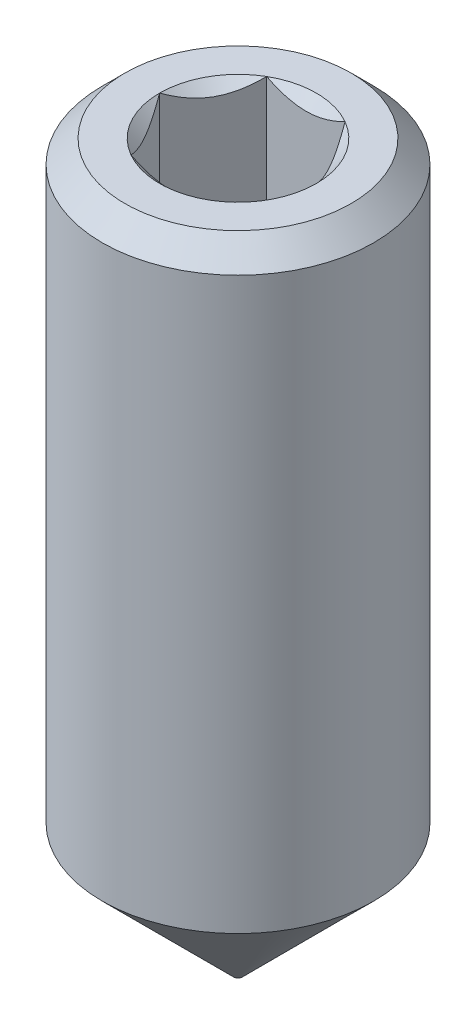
from build123d import *

# Parameters (mm, degrees)
ENL_V_MAT_EXTRU_1_DEPTH = 1.5


with BuildPart() as part:
    # Esquisse1 → R_volution1 (revolve)
    with BuildSketch(Plane.XY, mode=Mode.PRIVATE) as r_volution1_sk:
        Polygon((0, 8), (1.25, 8), (1.5, 7.75), (1.5, 1.45), (0.05, 0), (0, 0), align=None)
    revolve(r_volution1_sk.sketch.rotate(Axis((0, 0, 0), (0, 1, 0)), 90), axis=Axis((0, 0, 0), (0, 1, 0)))

    # Esquisse2 → Enl_v. mat.-Extru.1 (cut)
    with BuildSketch(Plane.ZX.offset(8)):
        Polygon((0.75, 0.433012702), (0, 0.866025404), (-0.75, 0.433012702), (-0.75, -0.433012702), (0, -0.866025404), (0.75, -0.433012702), align=None)
    extrude(amount=-ENL_V_MAT_EXTRU_1_DEPTH, mode=Mode.SUBTRACT)

    # Enl_v. mat.-Extru.2 cone 1 section (on through the dimple's axis) → Enl_v. mat.-Extru.2 (revolve, cut)
    with BuildSketch(Plane(origin=(0, 8, 0), x_dir=(0, 0, 1), z_dir=(1, 0, 0))):
        Polygon((0, 0), (0.866025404, 0), (0, 0.866025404), align=None)
    revolve(axis=Axis((0, 8, 0), (0, -1, 0)), mode=Mode.SUBTRACT)


solid = part.part
